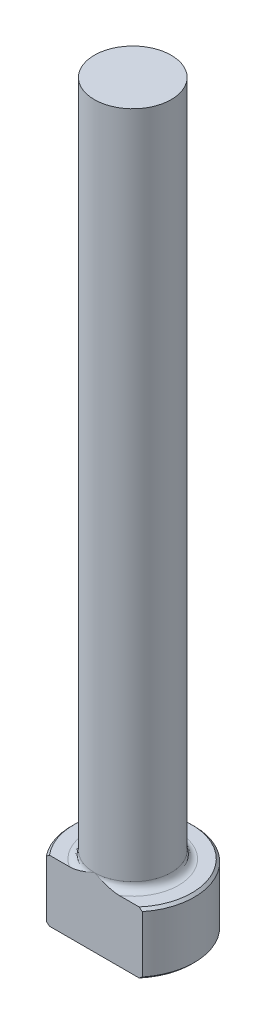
from build123d import *

# Parameters (mm, degrees)
CHAMFER1_SIZE = 0.254
FILLET1_R     = 0.762
KEY_DEPTH     = 77.727341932


with BuildPart() as part:
    # Sketch1 → Revolve1 (revolve)
    with BuildSketch(Plane.XY, mode=Mode.PRIVATE) as revolve1_sk:
        Polygon((0, 0), (-6.35, 0), (-6.35, 6.35), (-3.96875, 6.35), (-3.96875, 76.2), (0, 76.2), align=None)
    revolve(revolve1_sk.sketch.rotate(Axis((0, 259.958771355, 0), (0, -1, 0)), 270), axis=Axis((0, 259.958771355, 0), (0, -1, 0)))

    # Chamfer1
    chamfer1_edges = [part.edges().sort_by_distance(p)[0] for p in [
        (0, 6.35, -6.35),
        (0, 0, -6.35),
    ]]
    chamfer(chamfer1_edges, length=CHAMFER1_SIZE)

    # Fillet1
    fillet1_edges = [part.edges().sort_by_distance(p)[0] for p in [
        (0, 6.35, -3.96875),
    ]]
    fillet(fillet1_edges, radius=FILLET1_R)

    # Sketch2 → Key (cut, through all)
    with BuildSketch(Plane(origin=(0, 0, 0), x_dir=(1, 0, 0), z_dir=(0, 1, 0))):
        with BuildLine():
            Line((-4.956967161, -3.96875), (4.956967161, -3.96875))
            ThreePointArc((4.956967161, -3.96875), (0, -6.35), (-4.956967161, -3.96875))
        make_face()
    extrude(amount=KEY_DEPTH, mode=Mode.SUBTRACT)


solid = part.part
